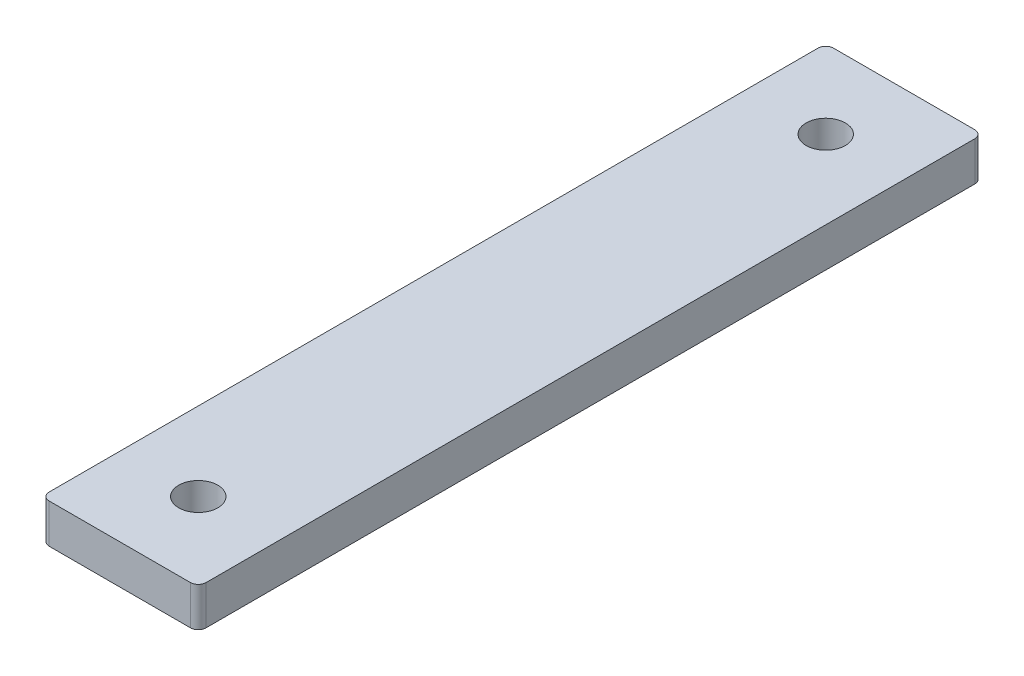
from build123d import *

# Parameters (mm, degrees)
SKETCH1_W           = 20
SKETCH1_H           = 100
SKETCH1_R           = 2.5
BOSS_EXTRUDE1_DEPTH = 5
FILLET1_R           = 1


with BuildPart() as part:
    # Sketch1 → Boss-Extrude1 (new body)
    with BuildSketch(Plane(origin=(0, 0, 0), x_dir=(1, 0, 0), z_dir=(0, 1, 0))):
        with Locations((10, 50)):
            Rectangle(SKETCH1_W, SKETCH1_H)
        with Locations(Location((10, 10, 0), (0, 0, 270))):
            Circle(SKETCH1_R, mode=Mode.SUBTRACT)
        with Locations(Location((10, 90, 0), (0, 0, 270))):
            Circle(SKETCH1_R, mode=Mode.SUBTRACT)
    extrude(amount=BOSS_EXTRUDE1_DEPTH)

    # Fillet1
    fillet1_edges = [part.edges().sort_by_distance(p)[0] for p in [
        (0, 2.5, -100),
        (20, 2.5, -100),
        (20, 2.5, 0),
        (0, 2.5, 0),
    ]]
    fillet(fillet1_edges, radius=FILLET1_R)


solid = part.part
